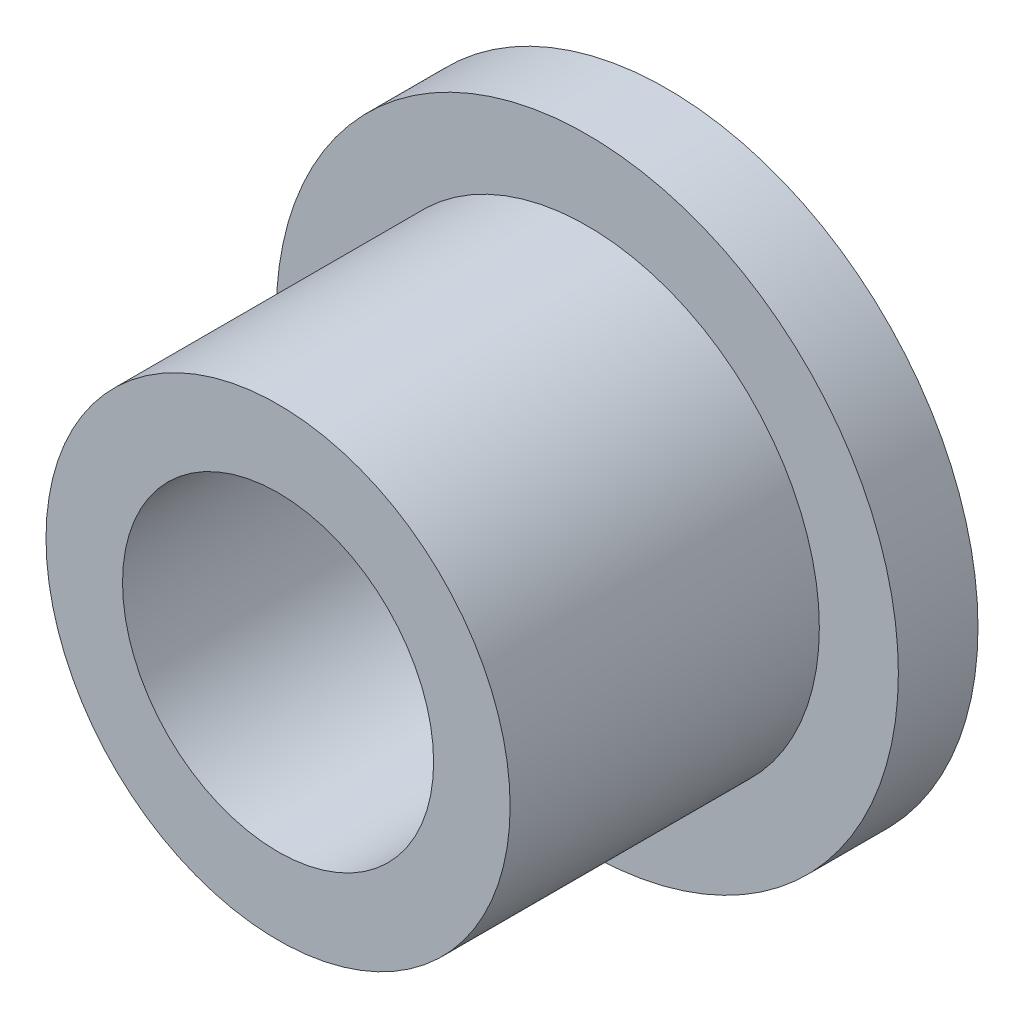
from build123d import *

# Parameters (mm, degrees)
SKETCH1_R           = 4.7371
BOSS_EXTRUDE1_DEPTH = 7.9375
SKETCH2_R           = 3.175
CUT_EXTRUDE1_DEPTH  = 11.386728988
SKETCH3_R           = 6.35
SKETCH3_R_2         = 4.7371
BOSS_EXTRUDE2_DEPTH = 1.6256


with BuildPart() as part:
    # Sketch1 → Boss-Extrude1 (new body)
    with BuildSketch(Plane.XY):
        Circle(SKETCH1_R)
    extrude(amount=BOSS_EXTRUDE1_DEPTH)

    # Sketch2 → Cut-Extrude1 (cut, through all)
    with BuildSketch(Plane(origin=(0, 0, 0), x_dir=(-1, 0, 0), z_dir=(0, 0, -1))):
        Circle(SKETCH2_R)
    extrude(amount=-CUT_EXTRUDE1_DEPTH, mode=Mode.SUBTRACT)

    # Sketch3 → Boss-Extrude2 (add)
    with BuildSketch(Plane(origin=(0, 0, 0), x_dir=(-1, 0, 0), z_dir=(0, 0, -1))):
        Circle(SKETCH3_R)
        Circle(SKETCH3_R_2, mode=Mode.SUBTRACT)
    extrude(amount=-BOSS_EXTRUDE2_DEPTH)


solid = part.part
